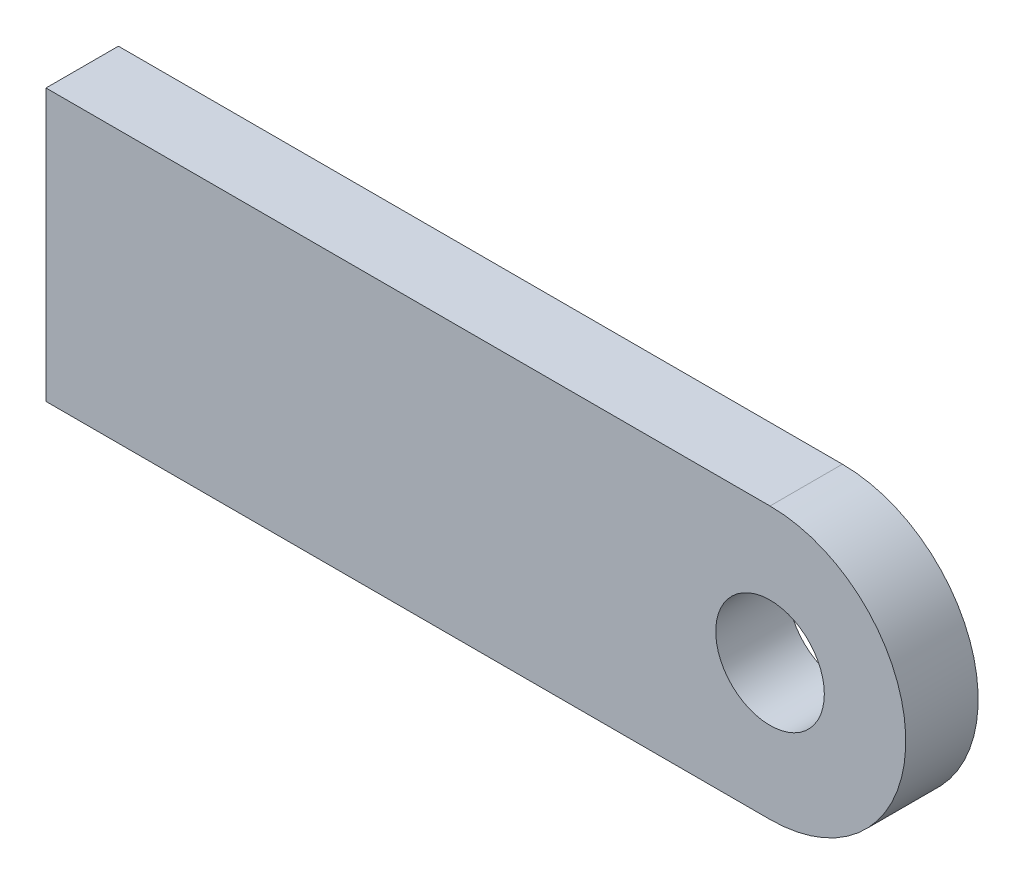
ISO-10303-21;
HEADER;
FILE_DESCRIPTION(('STEP AP214'),'2;1');
FILE_NAME('part.step','',(''),(''),'','','');
FILE_SCHEMA(('AUTOMOTIVE_DESIGN { 1 0 10303 214 1 1 1 1 }'));
ENDSEC;
DATA;
#1=APPLICATION_CONTEXT('core data for automotive mechanical design processes');
#2=APPLICATION_PROTOCOL_DEFINITION('international standard','automotive_design',2000,#1);
#3=PRODUCT_CONTEXT('',#1,'mechanical');
#4=PRODUCT('Part','Part','',(#3));
#5=PRODUCT_RELATED_PRODUCT_CATEGORY('part','',(#4));
#6=PRODUCT_DEFINITION_FORMATION('','',#4);
#7=PRODUCT_DEFINITION_CONTEXT('part definition',#1,'design');
#8=PRODUCT_DEFINITION('design','',#6,#7);
#9=PRODUCT_DEFINITION_SHAPE('','',#8);
#10=(LENGTH_UNIT() NAMED_UNIT(*) SI_UNIT(.MILLI.,.METRE.));
#11=(NAMED_UNIT(*) PLANE_ANGLE_UNIT() SI_UNIT($,.RADIAN.));
#12=(NAMED_UNIT(*) SI_UNIT($,.STERADIAN.) SOLID_ANGLE_UNIT());
#13=UNCERTAINTY_MEASURE_WITH_UNIT(LENGTH_MEASURE(1.E-05),#10,'distance_accuracy_value','');
#14=(GEOMETRIC_REPRESENTATION_CONTEXT(3) GLOBAL_UNCERTAINTY_ASSIGNED_CONTEXT((#13)) GLOBAL_UNIT_ASSIGNED_CONTEXT((#10,
#11,#12)) REPRESENTATION_CONTEXT('',''));
#15=CARTESIAN_POINT('',(0.,0.,0.));
#16=DIRECTION('',(0.,0.,1.));
#17=DIRECTION('',(1.,0.,0.));
#18=AXIS2_PLACEMENT_3D('',#15,#16,#17);
#19=CARTESIAN_POINT('',(50.8,-9.525,2.54));
#20=DIRECTION('',(0.,0.,-1.));
#21=DIRECTION('',(-1.,0.,0.));
#22=AXIS2_PLACEMENT_3D('',#19,#20,#21);
#23=CYLINDRICAL_SURFACE('',#22,9.525);
#24=CARTESIAN_POINT('',(50.8,-9.525,-2.54));
#25=DIRECTION('',(0.,0.,1.));
#26=DIRECTION('',(1.,0.,0.));
#27=AXIS2_PLACEMENT_3D('',#24,#25,#26);
#28=CIRCLE('',#27,9.525);
#29=CARTESIAN_POINT('',(50.8,0.,-2.54));
#30=VERTEX_POINT('',#29);
#31=CARTESIAN_POINT('',(50.8,-19.05,-2.54));
#32=VERTEX_POINT('',#31);
#33=EDGE_CURVE('E119',#30,#32,#28,.F.);
#34=ORIENTED_EDGE('',*,*,#33,.F.);
#35=DIRECTION('',(0.,0.,-1.));
#36=VECTOR('',#35,1.);
#37=CARTESIAN_POINT('',(50.8,0.,2.54));
#38=LINE('',#37,#36);
#39=CARTESIAN_POINT('',(50.8,0.,2.54));
#40=VERTEX_POINT('',#39);
#41=EDGE_CURVE('E11',#40,#30,#38,.T.);
#42=ORIENTED_EDGE('',*,*,#41,.F.);
#43=CARTESIAN_POINT('',(50.8,-9.525,2.54));
#44=DIRECTION('',(0.,0.,1.));
#45=DIRECTION('',(1.,0.,0.));
#46=AXIS2_PLACEMENT_3D('',#43,#44,#45);
#47=CIRCLE('',#46,9.525);
#48=CARTESIAN_POINT('',(50.8,-19.05,2.54));
#49=VERTEX_POINT('',#48);
#50=EDGE_CURVE('E104',#40,#49,#47,.F.);
#51=ORIENTED_EDGE('',*,*,#50,.T.);
#52=DIRECTION('',(0.,0.,-1.));
#53=VECTOR('',#52,1.);
#54=CARTESIAN_POINT('',(50.8,-19.05,2.54));
#55=LINE('',#54,#53);
#56=EDGE_CURVE('E64',#49,#32,#55,.T.);
#57=ORIENTED_EDGE('',*,*,#56,.T.);
#58=EDGE_LOOP('',(#34,#42,#51,#57));
#59=FACE_BOUND('',#58,.T.);
#60=ADVANCED_FACE('F46',(#59),#23,.T.);
#61=CARTESIAN_POINT('',(0.,0.,2.54));
#62=DIRECTION('',(0.,1.,0.));
#63=DIRECTION('',(0.,0.,1.));
#64=AXIS2_PLACEMENT_3D('',#61,#62,#63);
#65=PLANE('',#64);
#66=DIRECTION('',(1.,0.,0.));
#67=VECTOR('',#66,1.);
#68=CARTESIAN_POINT('',(0.,0.,-2.54));
#69=LINE('',#68,#67);
#70=CARTESIAN_POINT('',(0.,0.,-2.54));
#71=VERTEX_POINT('',#70);
#72=EDGE_CURVE('E94',#71,#30,#69,.T.);
#73=ORIENTED_EDGE('',*,*,#72,.F.);
#74=DIRECTION('',(0.,0.,-1.));
#75=VECTOR('',#74,1.);
#76=CARTESIAN_POINT('',(0.,0.,2.54));
#77=LINE('',#76,#75);
#78=CARTESIAN_POINT('',(0.,0.,2.54));
#79=VERTEX_POINT('',#78);
#80=EDGE_CURVE('E56',#79,#71,#77,.T.);
#81=ORIENTED_EDGE('',*,*,#80,.F.);
#82=DIRECTION('',(1.,0.,0.));
#83=VECTOR('',#82,1.);
#84=CARTESIAN_POINT('',(0.,0.,2.54));
#85=LINE('',#84,#83);
#86=EDGE_CURVE('E92',#79,#40,#85,.T.);
#87=ORIENTED_EDGE('',*,*,#86,.T.);
#88=ORIENTED_EDGE('',*,*,#41,.T.);
#89=EDGE_LOOP('',(#73,#81,#87,#88));
#90=FACE_BOUND('',#89,.T.);
#91=ADVANCED_FACE('F91',(#90),#65,.T.);
#92=CARTESIAN_POINT('',(0.,0.,2.54));
#93=DIRECTION('',(-1.,0.,0.));
#94=DIRECTION('',(0.,0.,1.));
#95=AXIS2_PLACEMENT_3D('',#92,#93,#94);
#96=PLANE('',#95);
#97=DIRECTION('',(0.,1.,0.));
#98=VECTOR('',#97,1.);
#99=CARTESIAN_POINT('',(0.,0.,-2.54));
#100=LINE('',#99,#98);
#101=CARTESIAN_POINT('',(0.,-19.05,-2.54));
#102=VERTEX_POINT('',#101);
#103=EDGE_CURVE('E124',#102,#71,#100,.T.);
#104=ORIENTED_EDGE('',*,*,#103,.F.);
#105=DIRECTION('',(0.,0.,-1.));
#106=VECTOR('',#105,1.);
#107=CARTESIAN_POINT('',(0.,-19.05,2.54));
#108=LINE('',#107,#106);
#109=CARTESIAN_POINT('',(0.,-19.05,2.54));
#110=VERTEX_POINT('',#109);
#111=EDGE_CURVE('E77',#110,#102,#108,.T.);
#112=ORIENTED_EDGE('',*,*,#111,.F.);
#113=DIRECTION('',(0.,1.,0.));
#114=VECTOR('',#113,1.);
#115=CARTESIAN_POINT('',(0.,0.,2.54));
#116=LINE('',#115,#114);
#117=EDGE_CURVE('E103',#110,#79,#116,.T.);
#118=ORIENTED_EDGE('',*,*,#117,.T.);
#119=ORIENTED_EDGE('',*,*,#80,.T.);
#120=EDGE_LOOP('',(#104,#112,#118,#119));
#121=FACE_BOUND('',#120,.T.);
#122=ADVANCED_FACE('F107',(#121),#96,.T.);
#123=CARTESIAN_POINT('',(50.8,-9.525,2.54));
#124=DIRECTION('',(0.,0.,-1.));
#125=DIRECTION('',(-1.,0.,0.));
#126=AXIS2_PLACEMENT_3D('',#123,#124,#125);
#127=CYLINDRICAL_SURFACE('',#126,3.81);
#128=CARTESIAN_POINT('',(50.8,-9.525,2.54));
#129=DIRECTION('',(0.,0.,1.));
#130=DIRECTION('',(1.,0.,0.));
#131=AXIS2_PLACEMENT_3D('',#128,#129,#130);
#132=CIRCLE('',#131,3.81);
#133=CARTESIAN_POINT('',(54.61,-9.525,2.54));
#134=VERTEX_POINT('',#133);
#135=EDGE_CURVE('E131',#134,#134,#132,.T.);
#136=ORIENTED_EDGE('',*,*,#135,.T.);
#137=EDGE_LOOP('',(#136));
#138=FACE_BOUND('',#137,.T.);
#139=CARTESIAN_POINT('',(50.8,-9.525,-2.54));
#140=DIRECTION('',(0.,0.,1.));
#141=DIRECTION('',(1.,0.,0.));
#142=AXIS2_PLACEMENT_3D('',#139,#140,#141);
#143=CIRCLE('',#142,3.81);
#144=CARTESIAN_POINT('',(54.61,-9.525,-2.54));
#145=VERTEX_POINT('',#144);
#146=EDGE_CURVE('E115',#145,#145,#143,.T.);
#147=ORIENTED_EDGE('',*,*,#146,.F.);
#148=EDGE_LOOP('',(#147));
#149=FACE_BOUND('',#148,.T.);
#150=ADVANCED_FACE('F48',(#138,#149),#127,.F.);
#151=CARTESIAN_POINT('',(0.,-19.05,2.54));
#152=DIRECTION('',(0.,-1.,0.));
#153=DIRECTION('',(1.,0.,0.));
#154=AXIS2_PLACEMENT_3D('',#151,#152,#153);
#155=PLANE('',#154);
#156=DIRECTION('',(-1.,0.,0.));
#157=VECTOR('',#156,1.);
#158=CARTESIAN_POINT('',(0.,-19.05,-2.54));
#159=LINE('',#158,#157);
#160=EDGE_CURVE('E127',#32,#102,#159,.T.);
#161=ORIENTED_EDGE('',*,*,#160,.F.);
#162=ORIENTED_EDGE('',*,*,#56,.F.);
#163=DIRECTION('',(-1.,0.,0.));
#164=VECTOR('',#163,1.);
#165=CARTESIAN_POINT('',(0.,-19.05,2.54));
#166=LINE('',#165,#164);
#167=EDGE_CURVE('E109',#49,#110,#166,.T.);
#168=ORIENTED_EDGE('',*,*,#167,.T.);
#169=ORIENTED_EDGE('',*,*,#111,.T.);
#170=EDGE_LOOP('',(#161,#162,#168,#169));
#171=FACE_BOUND('',#170,.T.);
#172=ADVANCED_FACE('F142',(#171),#155,.T.);
#173=CARTESIAN_POINT('',(0.,0.,2.54));
#174=DIRECTION('',(0.,0.,1.));
#175=DIRECTION('',(1.,0.,0.));
#176=AXIS2_PLACEMENT_3D('',#173,#174,#175);
#177=PLANE('',#176);
#178=ORIENTED_EDGE('',*,*,#135,.F.);
#179=EDGE_LOOP('',(#178));
#180=FACE_BOUND('',#179,.T.);
#181=ORIENTED_EDGE('',*,*,#50,.F.);
#182=ORIENTED_EDGE('',*,*,#86,.F.);
#183=ORIENTED_EDGE('',*,*,#117,.F.);
#184=ORIENTED_EDGE('',*,*,#167,.F.);
#185=EDGE_LOOP('',(#181,#182,#183,#184));
#186=FACE_BOUND('',#185,.T.);
#187=ADVANCED_FACE('F101',(#180,#186),#177,.T.);
#188=CARTESIAN_POINT('',(0.,0.,-2.54));
#189=DIRECTION('',(0.,0.,1.));
#190=DIRECTION('',(1.,0.,0.));
#191=AXIS2_PLACEMENT_3D('',#188,#189,#190);
#192=PLANE('',#191);
#193=ORIENTED_EDGE('',*,*,#146,.T.);
#194=EDGE_LOOP('',(#193));
#195=FACE_BOUND('',#194,.T.);
#196=ORIENTED_EDGE('',*,*,#33,.T.);
#197=ORIENTED_EDGE('',*,*,#160,.T.);
#198=ORIENTED_EDGE('',*,*,#103,.T.);
#199=ORIENTED_EDGE('',*,*,#72,.T.);
#200=EDGE_LOOP('',(#196,#197,#198,#199));
#201=FACE_BOUND('',#200,.T.);
#202=ADVANCED_FACE('F149',(#195,#201),#192,.F.);
#203=CLOSED_SHELL('',(#60,#91,#122,#150,#172,#187,#202));
#204=MANIFOLD_SOLID_BREP('B2',#203);
#205=ADVANCED_BREP_SHAPE_REPRESENTATION('',(#18,#204),#14);
#206=SHAPE_DEFINITION_REPRESENTATION(#9,#205);
ENDSEC;
END-ISO-10303-21;
